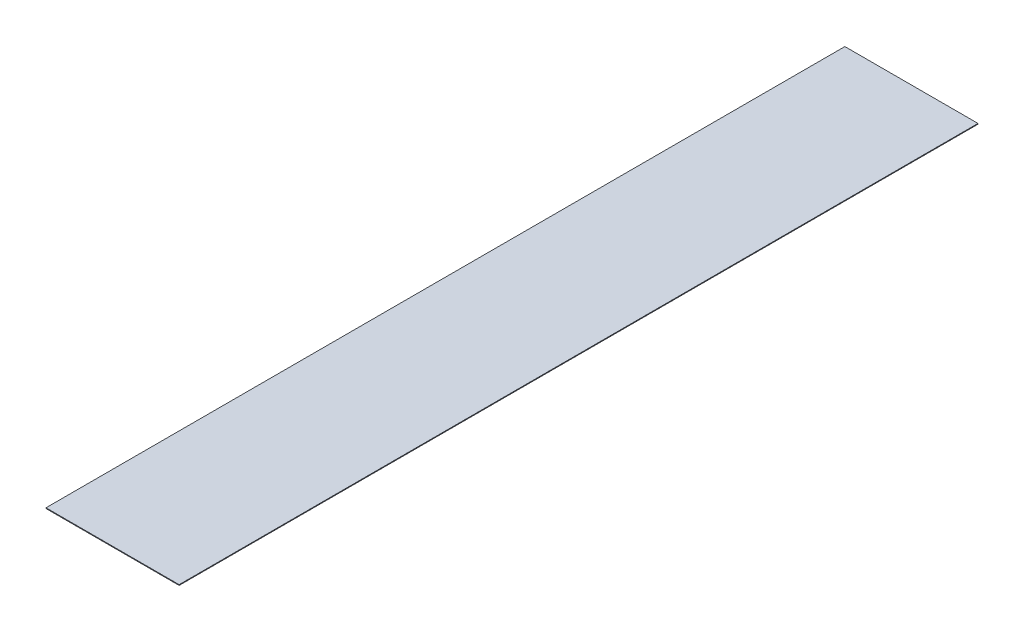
ISO-10303-21;
HEADER;
FILE_DESCRIPTION(('STEP AP214'),'2;1');
FILE_NAME('part.step','',(''),(''),'','','');
FILE_SCHEMA(('AUTOMOTIVE_DESIGN { 1 0 10303 214 1 1 1 1 }'));
ENDSEC;
DATA;
#1=APPLICATION_CONTEXT('core data for automotive mechanical design processes');
#2=APPLICATION_PROTOCOL_DEFINITION('international standard','automotive_design',2000,#1);
#3=PRODUCT_CONTEXT('',#1,'mechanical');
#4=PRODUCT('Part','Part','',(#3));
#5=PRODUCT_RELATED_PRODUCT_CATEGORY('part','',(#4));
#6=PRODUCT_DEFINITION_FORMATION('','',#4);
#7=PRODUCT_DEFINITION_CONTEXT('part definition',#1,'design');
#8=PRODUCT_DEFINITION('design','',#6,#7);
#9=PRODUCT_DEFINITION_SHAPE('','',#8);
#10=(LENGTH_UNIT() NAMED_UNIT(*) SI_UNIT(.MILLI.,.METRE.));
#11=(NAMED_UNIT(*) PLANE_ANGLE_UNIT() SI_UNIT($,.RADIAN.));
#12=(NAMED_UNIT(*) SI_UNIT($,.STERADIAN.) SOLID_ANGLE_UNIT());
#13=UNCERTAINTY_MEASURE_WITH_UNIT(LENGTH_MEASURE(1.E-05),#10,'distance_accuracy_value','');
#14=(GEOMETRIC_REPRESENTATION_CONTEXT(3) GLOBAL_UNCERTAINTY_ASSIGNED_CONTEXT((#13)) GLOBAL_UNIT_ASSIGNED_CONTEXT((#10,
#11,#12)) REPRESENTATION_CONTEXT('',''));
#15=CARTESIAN_POINT('',(0.,0.,0.));
#16=DIRECTION('',(0.,0.,1.));
#17=DIRECTION('',(1.,0.,0.));
#18=AXIS2_PLACEMENT_3D('',#15,#16,#17);
#19=CARTESIAN_POINT('',(0.,0.5,0.));
#20=DIRECTION('',(1.,0.,0.));
#21=DIRECTION('',(0.,0.,-1.));
#22=AXIS2_PLACEMENT_3D('',#19,#20,#21);
#23=PLANE('',#22);
#24=DIRECTION('',(0.,0.,1.));
#25=VECTOR('',#24,1.);
#26=CARTESIAN_POINT('',(0.,0.,0.));
#27=LINE('',#26,#25);
#28=CARTESIAN_POINT('',(0.,0.,-570.));
#29=VERTEX_POINT('',#28);
#30=CARTESIAN_POINT('',(0.,0.,0.));
#31=VERTEX_POINT('',#30);
#32=EDGE_CURVE('E70',#29,#31,#27,.T.);
#33=ORIENTED_EDGE('',*,*,#32,.T.);
#34=DIRECTION('',(0.,-1.,0.));
#35=VECTOR('',#34,1.);
#36=CARTESIAN_POINT('',(0.,0.5,0.));
#37=LINE('',#36,#35);
#38=CARTESIAN_POINT('',(0.,0.5,0.));
#39=VERTEX_POINT('',#38);
#40=EDGE_CURVE('E11',#39,#31,#37,.T.);
#41=ORIENTED_EDGE('',*,*,#40,.F.);
#42=DIRECTION('',(0.,0.,1.));
#43=VECTOR('',#42,1.);
#44=CARTESIAN_POINT('',(0.,0.5,0.));
#45=LINE('',#44,#43);
#46=CARTESIAN_POINT('',(0.,0.5,-570.));
#47=VERTEX_POINT('',#46);
#48=EDGE_CURVE('E88',#47,#39,#45,.T.);
#49=ORIENTED_EDGE('',*,*,#48,.F.);
#50=DIRECTION('',(0.,-1.,0.));
#51=VECTOR('',#50,1.);
#52=CARTESIAN_POINT('',(0.,0.5,-570.));
#53=LINE('',#52,#51);
#54=EDGE_CURVE('E82',#47,#29,#53,.T.);
#55=ORIENTED_EDGE('',*,*,#54,.T.);
#56=EDGE_LOOP('',(#33,#41,#49,#55));
#57=FACE_BOUND('',#56,.T.);
#58=ADVANCED_FACE('F26',(#57),#23,.F.);
#59=CARTESIAN_POINT('',(0.,0.5,0.));
#60=DIRECTION('',(0.,0.,-1.));
#61=DIRECTION('',(-1.,0.,0.));
#62=AXIS2_PLACEMENT_3D('',#59,#60,#61);
#63=PLANE('',#62);
#64=DIRECTION('',(1.,0.,0.));
#65=VECTOR('',#64,1.);
#66=CARTESIAN_POINT('',(0.,0.,0.));
#67=LINE('',#66,#65);
#68=CARTESIAN_POINT('',(95.,0.,0.));
#69=VERTEX_POINT('',#68);
#70=EDGE_CURVE('E66',#31,#69,#67,.T.);
#71=ORIENTED_EDGE('',*,*,#70,.T.);
#72=DIRECTION('',(0.,-1.,0.));
#73=VECTOR('',#72,1.);
#74=CARTESIAN_POINT('',(95.,0.5,0.));
#75=LINE('',#74,#73);
#76=CARTESIAN_POINT('',(95.,0.5,0.));
#77=VERTEX_POINT('',#76);
#78=EDGE_CURVE('E33',#77,#69,#75,.T.);
#79=ORIENTED_EDGE('',*,*,#78,.F.);
#80=DIRECTION('',(1.,0.,0.));
#81=VECTOR('',#80,1.);
#82=CARTESIAN_POINT('',(0.,0.5,0.));
#83=LINE('',#82,#81);
#84=EDGE_CURVE('E78',#39,#77,#83,.T.);
#85=ORIENTED_EDGE('',*,*,#84,.F.);
#86=ORIENTED_EDGE('',*,*,#40,.T.);
#87=EDGE_LOOP('',(#71,#79,#85,#86));
#88=FACE_BOUND('',#87,.T.);
#89=ADVANCED_FACE('F77',(#88),#63,.F.);
#90=CARTESIAN_POINT('',(95.,0.5,0.));
#91=DIRECTION('',(-1.,0.,0.));
#92=DIRECTION('',(0.,0.,1.));
#93=AXIS2_PLACEMENT_3D('',#90,#91,#92);
#94=PLANE('',#93);
#95=DIRECTION('',(0.,0.,-1.));
#96=VECTOR('',#95,1.);
#97=CARTESIAN_POINT('',(95.,0.,0.));
#98=LINE('',#97,#96);
#99=CARTESIAN_POINT('',(95.,0.,-570.));
#100=VERTEX_POINT('',#99);
#101=EDGE_CURVE('E71',#69,#100,#98,.T.);
#102=ORIENTED_EDGE('',*,*,#101,.T.);
#103=DIRECTION('',(0.,-1.,0.));
#104=VECTOR('',#103,1.);
#105=CARTESIAN_POINT('',(95.,0.5,-570.));
#106=LINE('',#105,#104);
#107=CARTESIAN_POINT('',(95.,0.5,-570.));
#108=VERTEX_POINT('',#107);
#109=EDGE_CURVE('E94',#108,#100,#106,.T.);
#110=ORIENTED_EDGE('',*,*,#109,.F.);
#111=DIRECTION('',(0.,0.,-1.));
#112=VECTOR('',#111,1.);
#113=CARTESIAN_POINT('',(95.,0.5,0.));
#114=LINE('',#113,#112);
#115=EDGE_CURVE('E45',#77,#108,#114,.T.);
#116=ORIENTED_EDGE('',*,*,#115,.F.);
#117=ORIENTED_EDGE('',*,*,#78,.T.);
#118=EDGE_LOOP('',(#102,#110,#116,#117));
#119=FACE_BOUND('',#118,.T.);
#120=ADVANCED_FACE('F97',(#119),#94,.F.);
#121=CARTESIAN_POINT('',(0.,0.5,-570.));
#122=DIRECTION('',(0.,0.,1.));
#123=DIRECTION('',(1.,0.,0.));
#124=AXIS2_PLACEMENT_3D('',#121,#122,#123);
#125=PLANE('',#124);
#126=DIRECTION('',(-1.,0.,0.));
#127=VECTOR('',#126,1.);
#128=CARTESIAN_POINT('',(0.,0.,-570.));
#129=LINE('',#128,#127);
#130=EDGE_CURVE('E86',#100,#29,#129,.T.);
#131=ORIENTED_EDGE('',*,*,#130,.T.);
#132=ORIENTED_EDGE('',*,*,#54,.F.);
#133=DIRECTION('',(-1.,0.,0.));
#134=VECTOR('',#133,1.);
#135=CARTESIAN_POINT('',(0.,0.5,-570.));
#136=LINE('',#135,#134);
#137=EDGE_CURVE('E40',#108,#47,#136,.T.);
#138=ORIENTED_EDGE('',*,*,#137,.F.);
#139=ORIENTED_EDGE('',*,*,#109,.T.);
#140=EDGE_LOOP('',(#131,#132,#138,#139));
#141=FACE_BOUND('',#140,.T.);
#142=ADVANCED_FACE('F99',(#141),#125,.F.);
#143=CARTESIAN_POINT('',(0.,0.5,-570.));
#144=DIRECTION('',(0.,-1.,0.));
#145=DIRECTION('',(0.,0.,-1.));
#146=AXIS2_PLACEMENT_3D('',#143,#144,#145);
#147=PLANE('',#146);
#148=ORIENTED_EDGE('',*,*,#48,.T.);
#149=ORIENTED_EDGE('',*,*,#84,.T.);
#150=ORIENTED_EDGE('',*,*,#115,.T.);
#151=ORIENTED_EDGE('',*,*,#137,.T.);
#152=EDGE_LOOP('',(#148,#149,#150,#151));
#153=FACE_BOUND('',#152,.T.);
#154=ADVANCED_FACE('F100',(#153),#147,.F.);
#155=CARTESIAN_POINT('',(0.,0.,-570.));
#156=DIRECTION('',(0.,-1.,0.));
#157=DIRECTION('',(0.,0.,-1.));
#158=AXIS2_PLACEMENT_3D('',#155,#156,#157);
#159=PLANE('',#158);
#160=ORIENTED_EDGE('',*,*,#32,.F.);
#161=ORIENTED_EDGE('',*,*,#130,.F.);
#162=ORIENTED_EDGE('',*,*,#101,.F.);
#163=ORIENTED_EDGE('',*,*,#70,.F.);
#164=EDGE_LOOP('',(#160,#161,#162,#163));
#165=FACE_BOUND('',#164,.T.);
#166=ADVANCED_FACE('F67',(#165),#159,.T.);
#167=CLOSED_SHELL('',(#58,#89,#120,#142,#154,#166));
#168=MANIFOLD_SOLID_BREP('B2',#167);
#169=ADVANCED_BREP_SHAPE_REPRESENTATION('',(#18,#168),#14);
#170=SHAPE_DEFINITION_REPRESENTATION(#9,#169);
ENDSEC;
END-ISO-10303-21;
